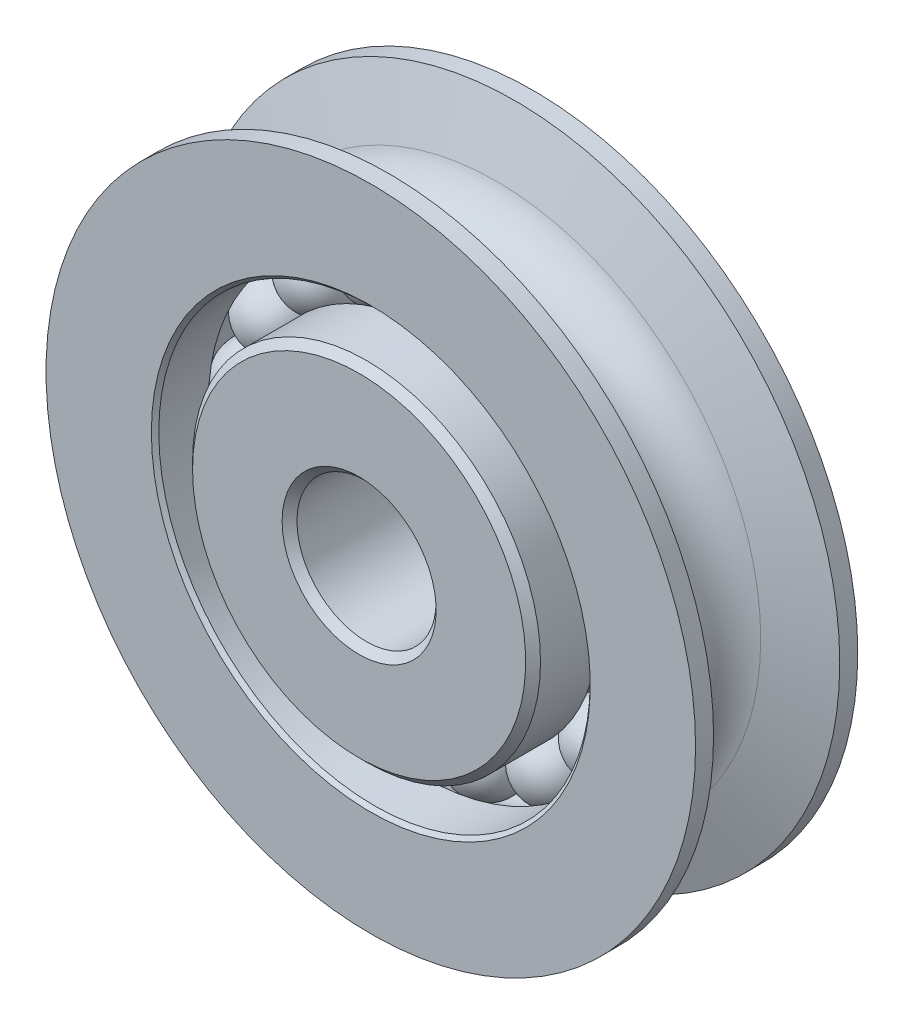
from build123d import *

# Parameters (mm, degrees)
CIRPATTERN1_COUNT = 17
CHAMFER1_SIZE     = 0.508
CHAMFER2_SIZE     = 0.254


with BuildPart() as part:
    # Sketch1 → Revolve1 (revolve)
    with BuildSketch(Plane(origin=(0, 0, 0), x_dir=(0, 0, -1), z_dir=(1, 0, 0)), mode=Mode.PRIVATE) as revolve1_sk:
        with BuildLine():
            Line((4.318, 22.225), (5.5499, 22.225))
            Line((5.5499, 22.225), (5.5499, 14.76375))
            Line((5.5499, 14.76375), (1.905, 14.76375))
            ThreePointArc((1.905, 14.76375), (0, 15.71625), (-1.905, 14.76375))
            Line((-1.905, 14.76375), (-5.5499, 14.76375))
            Line((-5.5499, 14.76375), (-5.5499, 22.225))
            Line((-5.5499, 22.225), (-4.318, 22.225))
            Line((-4.318, 22.225), (-3.030600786, 18.103382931))
            ThreePointArc((-3.030600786, 18.103382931), (0, 15.875), (3.030600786, 18.103382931))
            Line((3.030600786, 18.103382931), (4.318, 22.225))
        make_face()
        with BuildLine():
            Line((6.35, 4.7625), (-6.35, 4.7625))
            Line((-6.35, 4.7625), (-6.35, 11.90625))
            Line((-6.35, 11.90625), (-1.905, 11.90625))
            ThreePointArc((-1.905, 11.90625), (0, 10.95375), (1.905, 11.90625))
            Line((1.905, 11.90625), (6.35, 11.90625))
            Line((6.35, 11.90625), (6.35, 4.7625))
        make_face()
    revolve(revolve1_sk.sketch.rotate(Axis((0, 0, 6.35), (0, 0, -1)), 90), axis=Axis((0, 0, 6.35), (0, 0, -1)))

    # Chamfer1
    chamfer1_edges = [part.edges().sort_by_distance(p)[0] for p in [
        (-11.90625, 0, 6.35),
        (-11.90625, 0, -6.35),
        (-4.7625, 0, -6.35),
        (-4.7625, 0, 6.35),
    ]]
    chamfer(chamfer1_edges, length=CHAMFER1_SIZE)

    # Chamfer2
    chamfer2_edges = [part.edges().sort_by_distance(p)[0] for p in [
        (-14.76375, 0, -5.5499),
        (-14.76375, 0, 5.5499),
    ]]
    chamfer(chamfer2_edges, length=CHAMFER2_SIZE)


with BuildPart() as body_2:
    # Sketch2 → Revolve2 (revolve)
    with BuildSketch(Plane(origin=(0, 0, 0), x_dir=(0, 0, -1), z_dir=(1, 0, 0))):
        with BuildLine():
            Line((0, 15.71625), (0, 10.95375))
            ThreePointArc((0, 10.95375), (2.38125, 13.335), (0, 15.71625))
        make_face()
    revolve(axis=Axis((0, 15.71625, 0), (0, -1, 0)))


with BuildPart() as cirpattern1_1:
    # CirPattern1: pattern copy
    add(body_2.part.rotate(Axis((0, 0, 0), (0, 0, 1)), 1 * 360 / CIRPATTERN1_COUNT))


with BuildPart() as cirpattern1_2:
    # CirPattern1: pattern copy
    add(body_2.part.rotate(Axis((0, 0, 0), (0, 0, 1)), 2 * 360 / CIRPATTERN1_COUNT))


with BuildPart() as cirpattern1_3:
    # CirPattern1: pattern copy
    add(body_2.part.rotate(Axis((0, 0, 0), (0, 0, 1)), 3 * 360 / CIRPATTERN1_COUNT))


with BuildPart() as cirpattern1_4:
    # CirPattern1: pattern copy
    add(body_2.part.rotate(Axis((0, 0, 0), (0, 0, 1)), 4 * 360 / CIRPATTERN1_COUNT))


with BuildPart() as cirpattern1_5:
    # CirPattern1: pattern copy
    add(body_2.part.rotate(Axis((0, 0, 0), (0, 0, 1)), 5 * 360 / CIRPATTERN1_COUNT))


with BuildPart() as cirpattern1_6:
    # CirPattern1: pattern copy
    add(body_2.part.rotate(Axis((0, 0, 0), (0, 0, 1)), 6 * 360 / CIRPATTERN1_COUNT))


with BuildPart() as cirpattern1_7:
    # CirPattern1: pattern copy
    add(body_2.part.rotate(Axis((0, 0, 0), (0, 0, 1)), 7 * 360 / CIRPATTERN1_COUNT))


with BuildPart() as cirpattern1_8:
    # CirPattern1: pattern copy
    add(body_2.part.rotate(Axis((0, 0, 0), (0, 0, 1)), 8 * 360 / CIRPATTERN1_COUNT))


with BuildPart() as cirpattern1_9:
    # CirPattern1: pattern copy
    add(body_2.part.rotate(Axis((0, 0, 0), (0, 0, 1)), 9 * 360 / CIRPATTERN1_COUNT))


with BuildPart() as cirpattern1_10:
    # CirPattern1: pattern copy
    add(body_2.part.rotate(Axis((0, 0, 0), (0, 0, 1)), 10 * 360 / CIRPATTERN1_COUNT))


with BuildPart() as cirpattern1_11:
    # CirPattern1: pattern copy
    add(body_2.part.rotate(Axis((0, 0, 0), (0, 0, 1)), 11 * 360 / CIRPATTERN1_COUNT))


with BuildPart() as cirpattern1_12:
    # CirPattern1: pattern copy
    add(body_2.part.rotate(Axis((0, 0, 0), (0, 0, 1)), 12 * 360 / CIRPATTERN1_COUNT))


with BuildPart() as cirpattern1_13:
    # CirPattern1: pattern copy
    add(body_2.part.rotate(Axis((0, 0, 0), (0, 0, 1)), 13 * 360 / CIRPATTERN1_COUNT))


with BuildPart() as cirpattern1_14:
    # CirPattern1: pattern copy
    add(body_2.part.rotate(Axis((0, 0, 0), (0, 0, 1)), 14 * 360 / CIRPATTERN1_COUNT))


with BuildPart() as cirpattern1_15:
    # CirPattern1: pattern copy
    add(body_2.part.rotate(Axis((0, 0, 0), (0, 0, 1)), 15 * 360 / CIRPATTERN1_COUNT))


with BuildPart() as cirpattern1_16:
    # CirPattern1: pattern copy
    add(body_2.part.rotate(Axis((0, 0, 0), (0, 0, 1)), 16 * 360 / CIRPATTERN1_COUNT))


solid = Compound([part.part, body_2.part, cirpattern1_1.part, cirpattern1_2.part, cirpattern1_3.part, cirpattern1_4.part, cirpattern1_5.part, cirpattern1_6.part, cirpattern1_7.part, cirpattern1_8.part, cirpattern1_9.part, cirpattern1_10.part, cirpattern1_11.part, cirpattern1_12.part, cirpattern1_13.part, cirpattern1_14.part, cirpattern1_15.part, cirpattern1_16.part])
